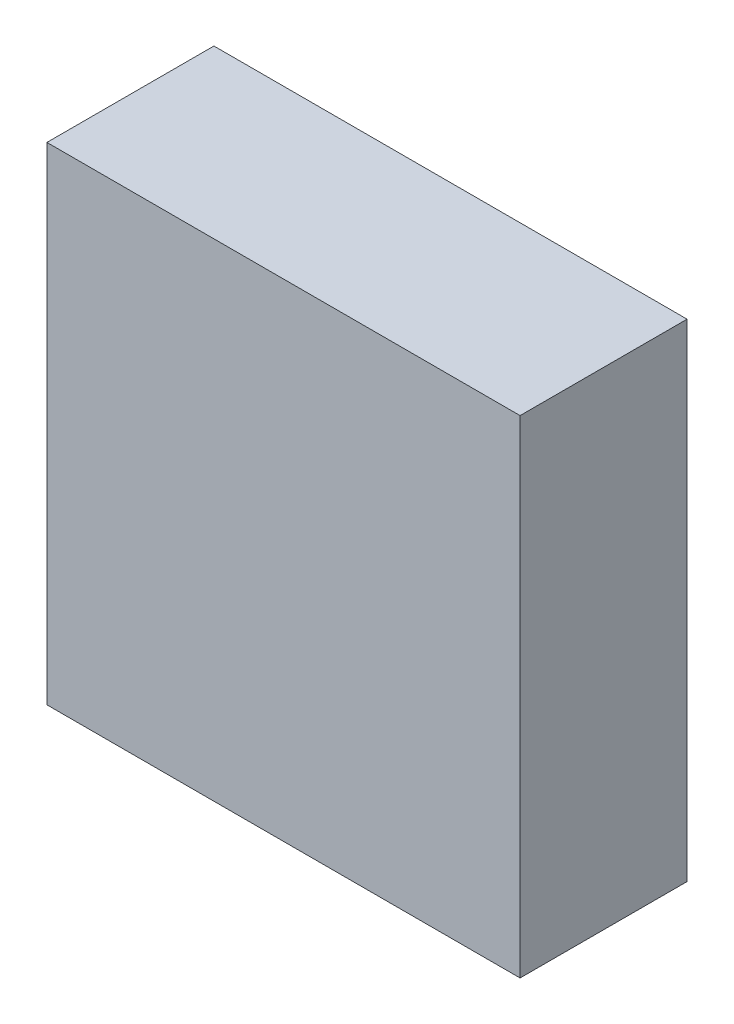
ISO-10303-21;
HEADER;
FILE_DESCRIPTION(('STEP AP214'),'2;1');
FILE_NAME('part.step','',(''),(''),'','','');
FILE_SCHEMA(('AUTOMOTIVE_DESIGN { 1 0 10303 214 1 1 1 1 }'));
ENDSEC;
DATA;
#1=APPLICATION_CONTEXT('core data for automotive mechanical design processes');
#2=APPLICATION_PROTOCOL_DEFINITION('international standard','automotive_design',2000,#1);
#3=PRODUCT_CONTEXT('',#1,'mechanical');
#4=PRODUCT('Part','Part','',(#3));
#5=PRODUCT_RELATED_PRODUCT_CATEGORY('part','',(#4));
#6=PRODUCT_DEFINITION_FORMATION('','',#4);
#7=PRODUCT_DEFINITION_CONTEXT('part definition',#1,'design');
#8=PRODUCT_DEFINITION('design','',#6,#7);
#9=PRODUCT_DEFINITION_SHAPE('','',#8);
#10=(LENGTH_UNIT() NAMED_UNIT(*) SI_UNIT(.MILLI.,.METRE.));
#11=(NAMED_UNIT(*) PLANE_ANGLE_UNIT() SI_UNIT($,.RADIAN.));
#12=(NAMED_UNIT(*) SI_UNIT($,.STERADIAN.) SOLID_ANGLE_UNIT());
#13=UNCERTAINTY_MEASURE_WITH_UNIT(LENGTH_MEASURE(1.E-05),#10,'distance_accuracy_value','');
#14=(GEOMETRIC_REPRESENTATION_CONTEXT(3) GLOBAL_UNCERTAINTY_ASSIGNED_CONTEXT((#13)) GLOBAL_UNIT_ASSIGNED_CONTEXT((#10,
#11,#12)) REPRESENTATION_CONTEXT('',''));
#15=CARTESIAN_POINT('',(0.,0.,0.));
#16=DIRECTION('',(0.,0.,1.));
#17=DIRECTION('',(1.,0.,0.));
#18=AXIS2_PLACEMENT_3D('',#15,#16,#17);
#19=CARTESIAN_POINT('',(-34.0000000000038,-34.999999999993,-23.9999999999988));
#20=DIRECTION('',(-0.999999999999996,0.,0.));
#21=DIRECTION('',(0.,-0.999999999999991,0.));
#22=AXIS2_PLACEMENT_3D('',#19,#20,#21);
#23=PLANE('',#22);
#24=CARTESIAN_POINT('',(-34.0000000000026,-22.999999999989,-11.9999999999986));
#25=DIRECTION('',(-0.999999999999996,0.,0.));
#26=DIRECTION('',(0.,-0.999999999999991,0.));
#27=AXIS2_PLACEMENT_3D('',#24,#25,#26);
#28=CIRCLE('',#27,6.69999999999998);
#29=CARTESIAN_POINT('',(-34.0000000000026,-22.999999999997,-5.29999999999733));
#30=VERTEX_POINT('',#29);
#31=EDGE_CURVE('E49',#30,#30,#28,.F.);
#32=ORIENTED_EDGE('',*,*,#31,.T.);
#33=EDGE_LOOP('',(#32));
#34=FACE_BOUND('',#33,.T.);
#35=CARTESIAN_POINT('',(-34.0000000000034,23.00000000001,-11.9999999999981));
#36=DIRECTION('',(-0.999999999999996,0.,0.));
#37=DIRECTION('',(0.,-0.999999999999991,0.));
#38=AXIS2_PLACEMENT_3D('',#35,#36,#37);
#39=CIRCLE('',#38,6.69999999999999);
#40=CARTESIAN_POINT('',(-34.0000000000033,23.0000000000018,-5.29999999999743));
#41=VERTEX_POINT('',#40);
#42=EDGE_CURVE('E137',#41,#41,#39,.F.);
#43=ORIENTED_EDGE('',*,*,#42,.T.);
#44=EDGE_LOOP('',(#43));
#45=FACE_BOUND('',#44,.T.);
#46=DIRECTION('',(0.,-0.999999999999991,0.));
#47=VECTOR('',#46,1.);
#48=CARTESIAN_POINT('',(-33.9999999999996,-34.999999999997,9.15933995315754E-13));
#49=LINE('',#48,#47);
#50=CARTESIAN_POINT('',(-34.0000000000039,35.0000000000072,1.45716771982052E-12));
#51=VERTEX_POINT('',#50);
#52=CARTESIAN_POINT('',(-33.9999999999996,-34.999999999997,9.15933995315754E-13));
#53=VERTEX_POINT('',#52);
#54=EDGE_CURVE('E108',#51,#53,#49,.T.);
#55=ORIENTED_EDGE('',*,*,#54,.F.);
#56=DIRECTION('',(0.,0.,0.999999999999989));
#57=VECTOR('',#56,1.);
#58=CARTESIAN_POINT('',(-34.000000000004,35.0000000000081,-23.9999999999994));
#59=LINE('',#58,#57);
#60=CARTESIAN_POINT('',(-34.000000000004,35.0000000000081,-23.9999999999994));
#61=VERTEX_POINT('',#60);
#62=EDGE_CURVE('E57',#61,#51,#59,.T.);
#63=ORIENTED_EDGE('',*,*,#62,.F.);
#64=DIRECTION('',(0.,-0.999999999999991,0.));
#65=VECTOR('',#64,1.);
#66=CARTESIAN_POINT('',(-34.0000000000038,-34.999999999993,-23.9999999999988));
#67=LINE('',#66,#65);
#68=CARTESIAN_POINT('',(-34.0000000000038,-34.999999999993,-23.9999999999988));
#69=VERTEX_POINT('',#68);
#70=EDGE_CURVE('E111',#61,#69,#67,.T.);
#71=ORIENTED_EDGE('',*,*,#70,.T.);
#72=DIRECTION('',(0.,0.,0.999999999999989));
#73=VECTOR('',#72,1.);
#74=CARTESIAN_POINT('',(-34.0000000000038,-34.999999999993,-23.9999999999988));
#75=LINE('',#74,#73);
#76=EDGE_CURVE('E86',#69,#53,#75,.T.);
#77=ORIENTED_EDGE('',*,*,#76,.T.);
#78=EDGE_LOOP('',(#55,#63,#71,#77));
#79=FACE_BOUND('',#78,.T.);
#80=ADVANCED_FACE('F40',(#34,#45,#79),#23,.T.);
#81=CARTESIAN_POINT('',(33.9999999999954,35.000000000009,-23.999999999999));
#82=DIRECTION('',(0.,0.999999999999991,0.));
#83=DIRECTION('',(-0.999999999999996,0.,0.));
#84=AXIS2_PLACEMENT_3D('',#81,#82,#83);
#85=PLANE('',#84);
#86=DIRECTION('',(-0.999999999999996,0.,0.));
#87=VECTOR('',#86,1.);
#88=CARTESIAN_POINT('',(33.9999999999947,35.0000000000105,6.52256026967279E-13));
#89=LINE('',#88,#87);
#90=CARTESIAN_POINT('',(33.9999999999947,35.0000000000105,6.52256026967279E-13));
#91=VERTEX_POINT('',#90);
#92=EDGE_CURVE('E114',#91,#51,#89,.T.);
#93=ORIENTED_EDGE('',*,*,#92,.F.);
#94=DIRECTION('',(0.,0.,0.999999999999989));
#95=VECTOR('',#94,1.);
#96=CARTESIAN_POINT('',(33.9999999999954,35.000000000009,-23.999999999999));
#97=LINE('',#96,#95);
#98=CARTESIAN_POINT('',(33.9999999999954,35.000000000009,-23.999999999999));
#99=VERTEX_POINT('',#98);
#100=EDGE_CURVE('E75',#99,#91,#97,.T.);
#101=ORIENTED_EDGE('',*,*,#100,.F.);
#102=DIRECTION('',(-0.999999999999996,0.,0.));
#103=VECTOR('',#102,1.);
#104=CARTESIAN_POINT('',(33.9999999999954,35.000000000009,-23.999999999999));
#105=LINE('',#104,#103);
#106=EDGE_CURVE('E118',#99,#61,#105,.T.);
#107=ORIENTED_EDGE('',*,*,#106,.T.);
#108=ORIENTED_EDGE('',*,*,#62,.T.);
#109=EDGE_LOOP('',(#93,#101,#107,#108));
#110=FACE_BOUND('',#109,.T.);
#111=ADVANCED_FACE('F167',(#110),#85,.T.);
#112=CARTESIAN_POINT('',(33.9999999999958,-34.9999999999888,-23.9999999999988));
#113=DIRECTION('',(0.999999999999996,0.,0.));
#114=DIRECTION('',(0.,0.999999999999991,0.));
#115=AXIS2_PLACEMENT_3D('',#112,#113,#114);
#116=PLANE('',#115);
#117=DIRECTION('',(0.,0.999999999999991,0.));
#118=VECTOR('',#117,1.);
#119=CARTESIAN_POINT('',(33.9999999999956,-34.9999999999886,3.60822483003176E-13));
#120=LINE('',#119,#118);
#121=CARTESIAN_POINT('',(33.9999999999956,-34.9999999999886,3.60822483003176E-13));
#122=VERTEX_POINT('',#121);
#123=EDGE_CURVE('E125',#122,#91,#120,.T.);
#124=ORIENTED_EDGE('',*,*,#123,.F.);
#125=DIRECTION('',(0.,0.,0.999999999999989));
#126=VECTOR('',#125,1.);
#127=CARTESIAN_POINT('',(33.9999999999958,-34.9999999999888,-23.9999999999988));
#128=LINE('',#127,#126);
#129=CARTESIAN_POINT('',(33.9999999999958,-34.9999999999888,-23.9999999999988));
#130=VERTEX_POINT('',#129);
#131=EDGE_CURVE('E132',#130,#122,#128,.T.);
#132=ORIENTED_EDGE('',*,*,#131,.F.);
#133=DIRECTION('',(0.,0.999999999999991,0.));
#134=VECTOR('',#133,1.);
#135=CARTESIAN_POINT('',(33.9999999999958,-34.9999999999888,-23.9999999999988));
#136=LINE('',#135,#134);
#137=EDGE_CURVE('E116',#130,#99,#136,.T.);
#138=ORIENTED_EDGE('',*,*,#137,.T.);
#139=ORIENTED_EDGE('',*,*,#100,.T.);
#140=EDGE_LOOP('',(#124,#132,#138,#139));
#141=FACE_BOUND('',#140,.T.);
#142=ADVANCED_FACE('F172',(#141),#116,.T.);
#143=CARTESIAN_POINT('',(33.9999999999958,-34.9999999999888,-23.9999999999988));
#144=DIRECTION('',(0.,-0.999999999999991,0.));
#145=DIRECTION('',(0.999999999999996,0.,0.));
#146=AXIS2_PLACEMENT_3D('',#143,#144,#145);
#147=PLANE('',#146);
#148=DIRECTION('',(0.999999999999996,0.,0.));
#149=VECTOR('',#148,1.);
#150=CARTESIAN_POINT('',(33.9999999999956,-34.9999999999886,3.60822483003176E-13));
#151=LINE('',#150,#149);
#152=EDGE_CURVE('E122',#53,#122,#151,.T.);
#153=ORIENTED_EDGE('',*,*,#152,.F.);
#154=ORIENTED_EDGE('',*,*,#76,.F.);
#155=DIRECTION('',(0.999999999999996,0.,0.));
#156=VECTOR('',#155,1.);
#157=CARTESIAN_POINT('',(33.9999999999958,-34.9999999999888,-23.9999999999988));
#158=LINE('',#157,#156);
#159=EDGE_CURVE('E113',#69,#130,#158,.T.);
#160=ORIENTED_EDGE('',*,*,#159,.T.);
#161=ORIENTED_EDGE('',*,*,#131,.T.);
#162=EDGE_LOOP('',(#153,#154,#160,#161));
#163=FACE_BOUND('',#162,.T.);
#164=ADVANCED_FACE('F175',(#163),#147,.T.);
#165=CARTESIAN_POINT('',(-3.44169137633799E-12,1.13242748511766E-11,-23.9999999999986));
#166=DIRECTION('',(0.,0.,0.999999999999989));
#167=DIRECTION('',(0.999999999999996,0.,0.));
#168=AXIS2_PLACEMENT_3D('',#165,#166,#167);
#169=PLANE('',#168);
#170=ORIENTED_EDGE('',*,*,#70,.F.);
#171=ORIENTED_EDGE('',*,*,#106,.F.);
#172=ORIENTED_EDGE('',*,*,#137,.F.);
#173=ORIENTED_EDGE('',*,*,#159,.F.);
#174=EDGE_LOOP('',(#170,#171,#172,#173));
#175=FACE_BOUND('',#174,.T.);
#176=ADVANCED_FACE('F162',(#175),#169,.F.);
#177=CARTESIAN_POINT('',(0.,0.,0.));
#178=DIRECTION('',(0.,0.,0.999999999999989));
#179=DIRECTION('',(0.999999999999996,0.,0.));
#180=AXIS2_PLACEMENT_3D('',#177,#178,#179);
#181=PLANE('',#180);
#182=ORIENTED_EDGE('',*,*,#54,.T.);
#183=ORIENTED_EDGE('',*,*,#152,.T.);
#184=ORIENTED_EDGE('',*,*,#123,.T.);
#185=ORIENTED_EDGE('',*,*,#92,.T.);
#186=EDGE_LOOP('',(#182,#183,#184,#185));
#187=FACE_BOUND('',#186,.T.);
#188=ADVANCED_FACE('F156',(#187),#181,.T.);
#189=CARTESIAN_POINT('',(-2.00000000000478,-22.9999999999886,-11.9999999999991));
#190=DIRECTION('',(-0.999999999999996,0.,0.));
#191=DIRECTION('',(0.,0.,0.999999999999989));
#192=AXIS2_PLACEMENT_3D('',#189,#190,#191);
#193=CONICAL_SURFACE('',#192,5.09999999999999,1.02974425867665);
#194=CARTESIAN_POINT('',(1.06438915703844,-22.9999999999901,-11.9999999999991));
#195=VERTEX_POINT('',#194);
#196=VERTEX_LOOP('',#195);
#197=FACE_BOUND('',#196,.T.);
#198=CARTESIAN_POINT('',(-2.00000000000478,-22.9999999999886,-11.9999999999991));
#199=DIRECTION('',(-0.999999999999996,0.,0.));
#200=DIRECTION('',(0.,0.,0.999999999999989));
#201=AXIS2_PLACEMENT_3D('',#198,#199,#200);
#202=CIRCLE('',#201,5.09999999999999);
#203=CARTESIAN_POINT('',(-2.00000000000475,-22.9999999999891,-6.8999999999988));
#204=VERTEX_POINT('',#203);
#205=EDGE_CURVE('E105',#204,#204,#202,.T.);
#206=ORIENTED_EDGE('',*,*,#205,.T.);
#207=EDGE_LOOP('',(#206));
#208=FACE_BOUND('',#207,.T.);
#209=ADVANCED_FACE('F151',(#197,#208),#193,.F.);
#210=CARTESIAN_POINT('',(-34.0000000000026,-22.999999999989,-11.9999999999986));
#211=DIRECTION('',(-0.999999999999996,0.,0.));
#212=DIRECTION('',(0.,0.,0.999999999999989));
#213=AXIS2_PLACEMENT_3D('',#210,#211,#212);
#214=CYLINDRICAL_SURFACE('',#213,5.09999999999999);
#215=CARTESIAN_POINT('',(-32.4000000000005,-22.999999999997,-11.9999999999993));
#216=DIRECTION('',(-0.999999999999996,0.,0.));
#217=DIRECTION('',(0.,0.,0.999999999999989));
#218=AXIS2_PLACEMENT_3D('',#215,#216,#217);
#219=CIRCLE('',#218,5.09999999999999);
#220=CARTESIAN_POINT('',(-32.4000000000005,-22.999999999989,-6.89999999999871));
#221=VERTEX_POINT('',#220);
#222=EDGE_CURVE('E130',#221,#221,#219,.T.);
#223=CARTESIAN_POINT('',(-32.4000000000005,-22.999999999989,-6.89999999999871));
#224=CARTESIAN_POINT('',(-32.0833333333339,-22.999999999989,-6.89999999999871));
#225=CARTESIAN_POINT('',(-31.7666666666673,-22.999999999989,-6.89999999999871));
#226=CARTESIAN_POINT('',(-31.133333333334,-22.999999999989,-6.89999999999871));
#227=CARTESIAN_POINT('',(-30.8166666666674,-22.999999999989,-6.89999999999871));
#228=CARTESIAN_POINT('',(-30.1833333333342,-22.999999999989,-6.89999999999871));
#229=CARTESIAN_POINT('',(-29.8666666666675,-22.999999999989,-6.89999999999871));
#230=CARTESIAN_POINT('',(-29.2333333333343,-22.999999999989,-6.89999999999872));
#231=CARTESIAN_POINT('',(-28.9166666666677,-22.999999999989,-6.89999999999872));
#232=CARTESIAN_POINT('',(-28.2833333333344,-22.999999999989,-6.89999999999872));
#233=CARTESIAN_POINT('',(-27.9666666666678,-22.999999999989,-6.89999999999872));
#234=CARTESIAN_POINT('',(-27.3333333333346,-22.999999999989,-6.89999999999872));
#235=CARTESIAN_POINT('',(-27.0166666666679,-22.999999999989,-6.89999999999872));
#236=CARTESIAN_POINT('',(-26.3833333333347,-22.999999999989,-6.89999999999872));
#237=CARTESIAN_POINT('',(-26.0666666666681,-22.999999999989,-6.89999999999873));
#238=CARTESIAN_POINT('',(-25.4333333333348,-22.999999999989,-6.89999999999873));
#239=CARTESIAN_POINT('',(-25.1166666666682,-22.999999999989,-6.89999999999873));
#240=CARTESIAN_POINT('',(-24.483333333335,-22.999999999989,-6.89999999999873));
#241=CARTESIAN_POINT('',(-24.1666666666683,-22.999999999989,-6.89999999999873));
#242=CARTESIAN_POINT('',(-23.5333333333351,-22.999999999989,-6.89999999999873));
#243=CARTESIAN_POINT('',(-23.2166666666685,-22.9999999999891,-6.89999999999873));
#244=CARTESIAN_POINT('',(-22.5833333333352,-22.9999999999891,-6.89999999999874));
#245=CARTESIAN_POINT('',(-22.2666666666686,-22.9999999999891,-6.89999999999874));
#246=CARTESIAN_POINT('',(-21.6333333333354,-22.9999999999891,-6.89999999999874));
#247=CARTESIAN_POINT('',(-21.3166666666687,-22.9999999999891,-6.89999999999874));
#248=CARTESIAN_POINT('',(-20.6833333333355,-22.9999999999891,-6.89999999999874));
#249=CARTESIAN_POINT('',(-20.3666666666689,-22.9999999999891,-6.89999999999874));
#250=CARTESIAN_POINT('',(-19.7333333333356,-22.9999999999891,-6.89999999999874));
#251=CARTESIAN_POINT('',(-19.416666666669,-22.9999999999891,-6.89999999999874));
#252=CARTESIAN_POINT('',(-18.7833333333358,-22.9999999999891,-6.89999999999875));
#253=CARTESIAN_POINT('',(-18.4666666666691,-22.9999999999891,-6.89999999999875));
#254=CARTESIAN_POINT('',(-17.8333333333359,-22.9999999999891,-6.89999999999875));
#255=CARTESIAN_POINT('',(-17.5166666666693,-22.9999999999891,-6.89999999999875));
#256=CARTESIAN_POINT('',(-16.883333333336,-22.9999999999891,-6.89999999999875));
#257=CARTESIAN_POINT('',(-16.5666666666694,-22.9999999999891,-6.89999999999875));
#258=CARTESIAN_POINT('',(-15.9333333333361,-22.9999999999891,-6.89999999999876));
#259=CARTESIAN_POINT('',(-15.6166666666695,-22.9999999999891,-6.89999999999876));
#260=CARTESIAN_POINT('',(-14.9833333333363,-22.9999999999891,-6.89999999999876));
#261=CARTESIAN_POINT('',(-14.6666666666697,-22.9999999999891,-6.89999999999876));
#262=CARTESIAN_POINT('',(-14.0333333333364,-22.9999999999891,-6.89999999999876));
#263=CARTESIAN_POINT('',(-13.7166666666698,-22.9999999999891,-6.89999999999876));
#264=CARTESIAN_POINT('',(-13.0833333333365,-22.9999999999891,-6.89999999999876));
#265=CARTESIAN_POINT('',(-12.7666666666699,-22.9999999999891,-6.89999999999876));
#266=CARTESIAN_POINT('',(-12.1333333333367,-22.9999999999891,-6.89999999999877));
#267=CARTESIAN_POINT('',(-11.8166666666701,-22.9999999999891,-6.89999999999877));
#268=CARTESIAN_POINT('',(-11.1833333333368,-22.9999999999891,-6.89999999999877));
#269=CARTESIAN_POINT('',(-10.8666666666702,-22.9999999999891,-6.89999999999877));
#270=CARTESIAN_POINT('',(-10.2333333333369,-22.9999999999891,-6.89999999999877));
#271=CARTESIAN_POINT('',(-9.91666666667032,-22.9999999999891,-6.89999999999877));
#272=CARTESIAN_POINT('',(-9.28333333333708,-22.9999999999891,-6.89999999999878));
#273=CARTESIAN_POINT('',(-8.96666666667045,-22.9999999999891,-6.89999999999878));
#274=CARTESIAN_POINT('',(-8.33333333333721,-22.9999999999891,-6.89999999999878));
#275=CARTESIAN_POINT('',(-8.01666666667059,-22.9999999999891,-6.89999999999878));
#276=CARTESIAN_POINT('',(-7.38333333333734,-22.9999999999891,-6.89999999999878));
#277=CARTESIAN_POINT('',(-7.06666666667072,-22.9999999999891,-6.89999999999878));
#278=CARTESIAN_POINT('',(-6.43333333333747,-22.9999999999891,-6.89999999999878));
#279=CARTESIAN_POINT('',(-6.11666666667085,-22.9999999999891,-6.89999999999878));
#280=CARTESIAN_POINT('',(-5.4833333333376,-22.9999999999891,-6.89999999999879));
#281=CARTESIAN_POINT('',(-5.16666666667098,-22.9999999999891,-6.89999999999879));
#282=CARTESIAN_POINT('',(-4.53333333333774,-22.9999999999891,-6.89999999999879));
#283=CARTESIAN_POINT('',(-4.21666666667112,-22.9999999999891,-6.89999999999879));
#284=CARTESIAN_POINT('',(-3.58333333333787,-22.9999999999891,-6.89999999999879));
#285=CARTESIAN_POINT('',(-3.26666666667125,-22.9999999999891,-6.89999999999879));
#286=CARTESIAN_POINT('',(-2.633333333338,-22.9999999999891,-6.8999999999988));
#287=CARTESIAN_POINT('',(-2.31666666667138,-22.9999999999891,-6.8999999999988));
#288=CARTESIAN_POINT('',(-2.00000000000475,-22.9999999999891,-6.8999999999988));
#289=B_SPLINE_CURVE_WITH_KNOTS('',3,(#223,#224,#225,#226,#227,#228,#229,#230,#231,#232,#233,
#234,#235,#236,#237,#238,#239,#240,#241,#242,#243,#244,#245,#246,#247,#248,#249,#250,#251,#252,
#253,#254,#255,#256,#257,#258,#259,#260,#261,#262,#263,#264,#265,#266,#267,#268,#269,#270,#271,
#272,#273,#274,#275,#276,#277,#278,#279,#280,#281,#282,#283,#284,#285,#286,#287,#288),
.UNSPECIFIED.,.F.,.F.,(4,2,2,2,2,2,2,2,2,2,2,2,2,2,2,2,2,2,2,2,2,2,2,2,2,2,2,2,2,2,2,2,4),(0.,
0.949999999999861,1.89999999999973,2.8499999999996,3.79999999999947,4.74999999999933,
5.6999999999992,6.64999999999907,7.59999999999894,8.54999999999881,9.49999999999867,
10.4499999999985,11.3999999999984,12.3499999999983,13.2999999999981,14.249999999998,
15.1999999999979,16.1499999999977,17.0999999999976,18.0499999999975,18.9999999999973,
19.9499999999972,20.8999999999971,21.849999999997,22.7999999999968,23.7499999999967,
24.6999999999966,25.6499999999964,26.5999999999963,27.5499999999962,28.499999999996,
29.4499999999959,30.3999999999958),.UNSPECIFIED.);
#290=EDGE_CURVE('BSEAM99',#221,#204,#289,.T.);
#291=ORIENTED_EDGE('',*,*,#222,.T.);
#292=ORIENTED_EDGE('',*,*,#205,.F.);
#293=ORIENTED_EDGE('',*,*,#290,.T.);
#294=ORIENTED_EDGE('',*,*,#290,.F.);
#295=EDGE_LOOP('',(#291,#293,#292,#294));
#296=FACE_BOUND('',#295,.T.);
#297=ADVANCED_FACE('F99',(#296),#214,.F.);
#298=CARTESIAN_POINT('',(-2.00000000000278,23.0000000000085,-11.9999999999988));
#299=DIRECTION('',(-0.999999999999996,0.,0.));
#300=DIRECTION('',(0.,0.,0.999999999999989));
#301=AXIS2_PLACEMENT_3D('',#298,#299,#300);
#302=CONICAL_SURFACE('',#301,5.09999999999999,1.02974425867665);
#303=CARTESIAN_POINT('',(1.06438915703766,23.0000000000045,-11.9999999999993));
#304=VERTEX_POINT('',#303);
#305=VERTEX_LOOP('',#304);
#306=FACE_BOUND('',#305,.T.);
#307=CARTESIAN_POINT('',(-2.00000000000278,23.0000000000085,-11.9999999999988));
#308=DIRECTION('',(-0.999999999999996,0.,0.));
#309=DIRECTION('',(0.,0.,0.999999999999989));
#310=AXIS2_PLACEMENT_3D('',#307,#308,#309);
#311=CIRCLE('',#310,5.09999999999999);
#312=CARTESIAN_POINT('',(-2.00000000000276,23.0000000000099,-6.89999999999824));
#313=VERTEX_POINT('',#312);
#314=EDGE_CURVE('E103',#313,#313,#311,.T.);
#315=ORIENTED_EDGE('',*,*,#314,.T.);
#316=EDGE_LOOP('',(#315));
#317=FACE_BOUND('',#316,.T.);
#318=ADVANCED_FACE('F95',(#306,#317),#302,.F.);
#319=CARTESIAN_POINT('',(-34.0000000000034,23.00000000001,-11.9999999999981));
#320=DIRECTION('',(-0.999999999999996,0.,0.));
#321=DIRECTION('',(0.,0.,0.999999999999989));
#322=AXIS2_PLACEMENT_3D('',#319,#320,#321);
#323=CYLINDRICAL_SURFACE('',#322,5.09999999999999);
#324=CARTESIAN_POINT('',(-32.4000000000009,23.0000000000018,-11.9999999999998));
#325=DIRECTION('',(-0.999999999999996,0.,0.));
#326=DIRECTION('',(0.,0.,0.999999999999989));
#327=AXIS2_PLACEMENT_3D('',#324,#325,#326);
#328=CIRCLE('',#327,5.09999999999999);
#329=CARTESIAN_POINT('',(-32.4000000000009,23.00000000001,-6.89999999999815));
#330=VERTEX_POINT('',#329);
#331=EDGE_CURVE('E11',#330,#330,#328,.T.);
#332=CARTESIAN_POINT('',(-32.4000000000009,23.00000000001,-6.89999999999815));
#333=CARTESIAN_POINT('',(-32.0833333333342,23.00000000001,-6.89999999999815));
#334=CARTESIAN_POINT('',(-31.7666666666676,23.00000000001,-6.89999999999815));
#335=CARTESIAN_POINT('',(-31.1333333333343,23.00000000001,-6.89999999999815));
#336=CARTESIAN_POINT('',(-30.8166666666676,23.00000000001,-6.89999999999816));
#337=CARTESIAN_POINT('',(-30.1833333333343,23.00000000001,-6.89999999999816));
#338=CARTESIAN_POINT('',(-29.8666666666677,23.00000000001,-6.89999999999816));
#339=CARTESIAN_POINT('',(-29.2333333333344,23.00000000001,-6.89999999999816));
#340=CARTESIAN_POINT('',(-28.9166666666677,23.00000000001,-6.89999999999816));
#341=CARTESIAN_POINT('',(-28.2833333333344,23.00000000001,-6.89999999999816));
#342=CARTESIAN_POINT('',(-27.9666666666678,23.00000000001,-6.89999999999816));
#343=CARTESIAN_POINT('',(-27.3333333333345,23.00000000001,-6.89999999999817));
#344=CARTESIAN_POINT('',(-27.0166666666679,23.00000000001,-6.89999999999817));
#345=CARTESIAN_POINT('',(-26.3833333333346,23.00000000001,-6.89999999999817));
#346=CARTESIAN_POINT('',(-26.0666666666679,23.00000000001,-6.89999999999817));
#347=CARTESIAN_POINT('',(-25.4333333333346,23.00000000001,-6.89999999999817));
#348=CARTESIAN_POINT('',(-25.116666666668,23.00000000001,-6.89999999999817));
#349=CARTESIAN_POINT('',(-24.4833333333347,23.00000000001,-6.89999999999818));
#350=CARTESIAN_POINT('',(-24.166666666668,23.00000000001,-6.89999999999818));
#351=CARTESIAN_POINT('',(-23.5333333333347,23.00000000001,-6.89999999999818));
#352=CARTESIAN_POINT('',(-23.2166666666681,23.00000000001,-6.89999999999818));
#353=CARTESIAN_POINT('',(-22.5833333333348,23.00000000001,-6.89999999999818));
#354=CARTESIAN_POINT('',(-22.2666666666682,23.00000000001,-6.89999999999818));
#355=CARTESIAN_POINT('',(-21.6333333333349,23.00000000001,-6.89999999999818));
#356=CARTESIAN_POINT('',(-21.3166666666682,23.00000000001,-6.89999999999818));
#357=CARTESIAN_POINT('',(-20.6833333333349,23.00000000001,-6.89999999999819));
#358=CARTESIAN_POINT('',(-20.3666666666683,23.00000000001,-6.89999999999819));
#359=CARTESIAN_POINT('',(-19.733333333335,23.00000000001,-6.89999999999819));
#360=CARTESIAN_POINT('',(-19.4166666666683,23.00000000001,-6.89999999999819));
#361=CARTESIAN_POINT('',(-18.783333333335,23.00000000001,-6.89999999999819));
#362=CARTESIAN_POINT('',(-18.4666666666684,23.00000000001,-6.89999999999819));
#363=CARTESIAN_POINT('',(-17.8333333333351,23.00000000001,-6.89999999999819));
#364=CARTESIAN_POINT('',(-17.5166666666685,23.00000000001,-6.8999999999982));
#365=CARTESIAN_POINT('',(-16.8833333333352,23.00000000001,-6.8999999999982));
#366=CARTESIAN_POINT('',(-16.5666666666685,23.00000000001,-6.8999999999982));
#367=CARTESIAN_POINT('',(-15.9333333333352,23.00000000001,-6.8999999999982));
#368=CARTESIAN_POINT('',(-15.6166666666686,23.00000000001,-6.8999999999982));
#369=CARTESIAN_POINT('',(-14.9833333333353,23.00000000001,-6.8999999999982));
#370=CARTESIAN_POINT('',(-14.6666666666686,23.00000000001,-6.8999999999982));
#371=CARTESIAN_POINT('',(-14.0333333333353,23.00000000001,-6.89999999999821));
#372=CARTESIAN_POINT('',(-13.7166666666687,23.00000000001,-6.89999999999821));
#373=CARTESIAN_POINT('',(-13.0833333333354,23.00000000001,-6.89999999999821));
#374=CARTESIAN_POINT('',(-12.7666666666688,23.00000000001,-6.89999999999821));
#375=CARTESIAN_POINT('',(-12.1333333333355,23.00000000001,-6.89999999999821));
#376=CARTESIAN_POINT('',(-11.8166666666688,23.00000000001,-6.89999999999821));
#377=CARTESIAN_POINT('',(-11.1833333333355,23.00000000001,-6.89999999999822));
#378=CARTESIAN_POINT('',(-10.8666666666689,23.00000000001,-6.89999999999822));
#379=CARTESIAN_POINT('',(-10.2333333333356,23.00000000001,-6.89999999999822));
#380=CARTESIAN_POINT('',(-9.91666666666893,23.00000000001,-6.89999999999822));
#381=CARTESIAN_POINT('',(-9.28333333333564,23.00000000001,-6.89999999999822));
#382=CARTESIAN_POINT('',(-8.96666666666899,23.00000000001,-6.89999999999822));
#383=CARTESIAN_POINT('',(-8.3333333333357,23.00000000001,-6.89999999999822));
#384=CARTESIAN_POINT('',(-8.01666666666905,23.00000000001,-6.89999999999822));
#385=CARTESIAN_POINT('',(-7.38333333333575,23.00000000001,-6.89999999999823));
#386=CARTESIAN_POINT('',(-7.06666666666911,23.00000000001,-6.89999999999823));
#387=CARTESIAN_POINT('',(-6.43333333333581,23.00000000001,-6.89999999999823));
#388=CARTESIAN_POINT('',(-6.11666666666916,23.0000000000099,-6.89999999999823));
#389=CARTESIAN_POINT('',(-5.48333333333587,23.0000000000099,-6.89999999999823));
#390=CARTESIAN_POINT('',(-5.16666666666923,23.0000000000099,-6.89999999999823));
#391=CARTESIAN_POINT('',(-4.53333333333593,23.0000000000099,-6.89999999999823));
#392=CARTESIAN_POINT('',(-4.21666666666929,23.0000000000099,-6.89999999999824));
#393=CARTESIAN_POINT('',(-3.58333333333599,23.0000000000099,-6.89999999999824));
#394=CARTESIAN_POINT('',(-3.26666666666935,23.0000000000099,-6.89999999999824));
#395=CARTESIAN_POINT('',(-2.63333333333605,23.0000000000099,-6.89999999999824));
#396=CARTESIAN_POINT('',(-2.3166666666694,23.0000000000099,-6.89999999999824));
#397=CARTESIAN_POINT('',(-2.00000000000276,23.0000000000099,-6.89999999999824));
#398=B_SPLINE_CURVE_WITH_KNOTS('',3,(#332,#333,#334,#335,#336,#337,#338,#339,#340,#341,#342,
#343,#344,#345,#346,#347,#348,#349,#350,#351,#352,#353,#354,#355,#356,#357,#358,#359,#360,#361,
#362,#363,#364,#365,#366,#367,#368,#369,#370,#371,#372,#373,#374,#375,#376,#377,#378,#379,#380,
#381,#382,#383,#384,#385,#386,#387,#388,#389,#390,#391,#392,#393,#394,#395,#396,#397),
.UNSPECIFIED.,.F.,.F.,(4,2,2,2,2,2,2,2,2,2,2,2,2,2,2,2,2,2,2,2,2,2,2,2,2,2,2,2,2,2,2,2,4),(0.,
0.949999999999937,1.89999999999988,2.84999999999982,3.79999999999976,4.7499999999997,
5.69999999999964,6.64999999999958,7.59999999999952,8.54999999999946,9.4999999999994,
10.4499999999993,11.3999999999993,12.3499999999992,13.2999999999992,14.2499999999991,
15.199999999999,16.149999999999,17.0999999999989,18.0499999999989,18.9999999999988,
19.9499999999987,20.8999999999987,21.8499999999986,22.7999999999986,23.7499999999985,
24.6999999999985,25.6499999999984,26.5999999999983,27.5499999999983,28.4999999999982,
29.4499999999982,30.3999999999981),.UNSPECIFIED.);
#399=EDGE_CURVE('BSEAM98',#330,#313,#398,.T.);
#400=ORIENTED_EDGE('',*,*,#331,.T.);
#401=ORIENTED_EDGE('',*,*,#314,.F.);
#402=ORIENTED_EDGE('',*,*,#399,.T.);
#403=ORIENTED_EDGE('',*,*,#399,.F.);
#404=EDGE_LOOP('',(#400,#402,#401,#403));
#405=FACE_BOUND('',#404,.T.);
#406=ADVANCED_FACE('F98',(#405),#323,.F.);
#407=CARTESIAN_POINT('',(-32.4000000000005,-22.999999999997,-11.9999999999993));
#408=DIRECTION('',(-0.999999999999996,0.,0.));
#409=DIRECTION('',(0.,0.,0.999999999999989));
#410=AXIS2_PLACEMENT_3D('',#407,#408,#409);
#411=CONICAL_SURFACE('',#410,5.09999999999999,0.785398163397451);
#412=CARTESIAN_POINT('',(-34.0000000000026,-22.999999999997,-5.29999999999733));
#413=CARTESIAN_POINT('',(-33.9833333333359,-22.999999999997,-5.31666666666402));
#414=CARTESIAN_POINT('',(-33.9666666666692,-22.999999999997,-5.33333333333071));
#415=CARTESIAN_POINT('',(-33.9333333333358,-22.999999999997,-5.36666666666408));
#416=CARTESIAN_POINT('',(-33.9166666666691,-22.999999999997,-5.38333333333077));
#417=CARTESIAN_POINT('',(-33.8833333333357,-22.999999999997,-5.41666666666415));
#418=CARTESIAN_POINT('',(-33.8666666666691,-22.999999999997,-5.43333333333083));
#419=CARTESIAN_POINT('',(-33.8333333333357,-22.999999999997,-5.46666666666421));
#420=CARTESIAN_POINT('',(-33.816666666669,-22.999999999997,-5.4833333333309));
#421=CARTESIAN_POINT('',(-33.7833333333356,-22.999999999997,-5.51666666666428));
#422=CARTESIAN_POINT('',(-33.7666666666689,-22.999999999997,-5.53333333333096));
#423=CARTESIAN_POINT('',(-33.7333333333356,-22.999999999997,-5.56666666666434));
#424=CARTESIAN_POINT('',(-33.7166666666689,-22.999999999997,-5.58333333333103));
#425=CARTESIAN_POINT('',(-33.6833333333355,-22.999999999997,-5.6166666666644));
#426=CARTESIAN_POINT('',(-33.6666666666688,-22.999999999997,-5.63333333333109));
#427=CARTESIAN_POINT('',(-33.6333333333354,-22.999999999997,-5.66666666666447));
#428=CARTESIAN_POINT('',(-33.6166666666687,-22.999999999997,-5.68333333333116));
#429=CARTESIAN_POINT('',(-33.5833333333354,-22.999999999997,-5.71666666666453));
#430=CARTESIAN_POINT('',(-33.5666666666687,-22.999999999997,-5.73333333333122));
#431=CARTESIAN_POINT('',(-33.5333333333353,-22.999999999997,-5.76666666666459));
#432=CARTESIAN_POINT('',(-33.5166666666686,-22.999999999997,-5.78333333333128));
#433=CARTESIAN_POINT('',(-33.4833333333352,-22.999999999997,-5.81666666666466));
#434=CARTESIAN_POINT('',(-33.4666666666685,-22.999999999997,-5.83333333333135));
#435=CARTESIAN_POINT('',(-33.4333333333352,-22.999999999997,-5.86666666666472));
#436=CARTESIAN_POINT('',(-33.4166666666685,-22.999999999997,-5.88333333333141));
#437=CARTESIAN_POINT('',(-33.3833333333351,-22.999999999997,-5.91666666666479));
#438=CARTESIAN_POINT('',(-33.3666666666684,-22.999999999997,-5.93333333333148));
#439=CARTESIAN_POINT('',(-33.333333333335,-22.999999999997,-5.96666666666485));
#440=CARTESIAN_POINT('',(-33.3166666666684,-22.999999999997,-5.98333333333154));
#441=CARTESIAN_POINT('',(-33.283333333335,-22.999999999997,-6.01666666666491));
#442=CARTESIAN_POINT('',(-33.2666666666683,-22.999999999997,-6.0333333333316));
#443=CARTESIAN_POINT('',(-33.2333333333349,-22.999999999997,-6.06666666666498));
#444=CARTESIAN_POINT('',(-33.2166666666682,-22.999999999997,-6.08333333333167));
#445=CARTESIAN_POINT('',(-33.1833333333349,-22.999999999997,-6.11666666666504));
#446=CARTESIAN_POINT('',(-33.1666666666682,-22.999999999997,-6.13333333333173));
#447=CARTESIAN_POINT('',(-33.1333333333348,-22.999999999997,-6.16666666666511));
#448=CARTESIAN_POINT('',(-33.1166666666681,-22.999999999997,-6.18333333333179));
#449=CARTESIAN_POINT('',(-33.0833333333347,-22.999999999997,-6.21666666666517));
#450=CARTESIAN_POINT('',(-33.066666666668,-22.999999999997,-6.23333333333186));
#451=CARTESIAN_POINT('',(-33.0333333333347,-22.999999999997,-6.26666666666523));
#452=CARTESIAN_POINT('',(-33.016666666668,-22.999999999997,-6.28333333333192));
#453=CARTESIAN_POINT('',(-32.9833333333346,-22.999999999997,-6.3166666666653));
#454=CARTESIAN_POINT('',(-32.9666666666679,-22.999999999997,-6.33333333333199));
#455=CARTESIAN_POINT('',(-32.9333333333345,-22.999999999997,-6.36666666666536));
#456=CARTESIAN_POINT('',(-32.9166666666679,-22.999999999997,-6.38333333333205));
#457=CARTESIAN_POINT('',(-32.8833333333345,-22.999999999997,-6.41666666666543));
#458=CARTESIAN_POINT('',(-32.8666666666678,-22.999999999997,-6.43333333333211));
#459=CARTESIAN_POINT('',(-32.8333333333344,-22.999999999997,-6.46666666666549));
#460=CARTESIAN_POINT('',(-32.8166666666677,-22.999999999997,-6.48333333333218));
#461=CARTESIAN_POINT('',(-32.7833333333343,-22.999999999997,-6.51666666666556));
#462=CARTESIAN_POINT('',(-32.7666666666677,-22.999999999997,-6.53333333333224));
#463=CARTESIAN_POINT('',(-32.7333333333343,-22.999999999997,-6.56666666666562));
#464=CARTESIAN_POINT('',(-32.7166666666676,-22.999999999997,-6.58333333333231));
#465=CARTESIAN_POINT('',(-32.6833333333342,-22.999999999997,-6.61666666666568));
#466=CARTESIAN_POINT('',(-32.6666666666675,-22.999999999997,-6.63333333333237));
#467=CARTESIAN_POINT('',(-32.6333333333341,-22.999999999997,-6.66666666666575));
#468=CARTESIAN_POINT('',(-32.6166666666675,-22.999999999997,-6.68333333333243));
#469=CARTESIAN_POINT('',(-32.5833333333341,-22.999999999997,-6.71666666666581));
#470=CARTESIAN_POINT('',(-32.5666666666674,-22.999999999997,-6.7333333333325));
#471=CARTESIAN_POINT('',(-32.533333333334,-22.999999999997,-6.76666666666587));
#472=CARTESIAN_POINT('',(-32.5166666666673,-22.999999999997,-6.78333333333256));
#473=CARTESIAN_POINT('',(-32.483333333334,-22.999999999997,-6.81666666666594));
#474=CARTESIAN_POINT('',(-32.4666666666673,-22.999999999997,-6.83333333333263));
#475=CARTESIAN_POINT('',(-32.4333333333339,-22.999999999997,-6.866666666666));
#476=CARTESIAN_POINT('',(-32.4166666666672,-22.999999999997,-6.88333333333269));
#477=CARTESIAN_POINT('',(-32.4000000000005,-22.999999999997,-6.89999999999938));
#478=B_SPLINE_CURVE_WITH_KNOTS('',3,(#412,#413,#414,#415,#416,#417,#418,#419,#420,#421,#422,
#423,#424,#425,#426,#427,#428,#429,#430,#431,#432,#433,#434,#435,#436,#437,#438,#439,#440,#441,
#442,#443,#444,#445,#446,#447,#448,#449,#450,#451,#452,#453,#454,#455,#456,#457,#458,#459,#460,
#461,#462,#463,#464,#465,#466,#467,#468,#469,#470,#471,#472,#473,#474,#475,#476,#477),
.UNSPECIFIED.,.F.,.F.,(4,2,2,2,2,2,2,2,2,2,2,2,2,2,2,2,2,2,2,2,2,2,2,2,2,2,2,2,2,2,2,2,4),(0.,
0.0707106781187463,0.141421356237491,0.212132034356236,0.282842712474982,0.353553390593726,
0.424264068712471,0.494974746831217,0.565685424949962,0.636396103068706,0.707106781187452,
0.777817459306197,0.848528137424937,0.919238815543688,0.989949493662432,1.06066017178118,
1.13137084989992,1.20208152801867,1.27279220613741,1.34350288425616,1.4142135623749,
1.48492424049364,1.55563491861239,1.62634559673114,1.69705627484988,1.76776695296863,
1.83847763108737,1.90918830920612,1.97989898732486,2.0506096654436,2.12132034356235,
2.1920310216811,2.26274169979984),.UNSPECIFIED.);
#479=EDGE_CURVE('BSEAM144',#30,#221,#478,.T.);
#480=ORIENTED_EDGE('',*,*,#31,.F.);
#481=ORIENTED_EDGE('',*,*,#222,.F.);
#482=ORIENTED_EDGE('',*,*,#479,.T.);
#483=ORIENTED_EDGE('',*,*,#479,.F.);
#484=EDGE_LOOP('',(#480,#482,#481,#483));
#485=FACE_BOUND('',#484,.T.);
#486=ADVANCED_FACE('F144',(#485),#411,.F.);
#487=CARTESIAN_POINT('',(-32.4000000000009,23.0000000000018,-11.9999999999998));
#488=DIRECTION('',(-0.999999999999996,0.,0.));
#489=DIRECTION('',(0.,0.,0.999999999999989));
#490=AXIS2_PLACEMENT_3D('',#487,#488,#489);
#491=CONICAL_SURFACE('',#490,5.09999999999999,0.785398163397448);
#492=CARTESIAN_POINT('',(-34.0000000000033,23.0000000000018,-5.29999999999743));
#493=CARTESIAN_POINT('',(-33.9833333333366,23.0000000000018,-5.31666666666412));
#494=CARTESIAN_POINT('',(-33.96666666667,23.0000000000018,-5.33333333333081));
#495=CARTESIAN_POINT('',(-33.9333333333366,23.0000000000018,-5.3666666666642));
#496=CARTESIAN_POINT('',(-33.9166666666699,23.0000000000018,-5.38333333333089));
#497=CARTESIAN_POINT('',(-33.8833333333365,23.0000000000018,-5.41666666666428));
#498=CARTESIAN_POINT('',(-33.8666666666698,23.0000000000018,-5.43333333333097));
#499=CARTESIAN_POINT('',(-33.8333333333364,23.0000000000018,-5.46666666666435));
#500=CARTESIAN_POINT('',(-33.8166666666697,23.0000000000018,-5.48333333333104));
#501=CARTESIAN_POINT('',(-33.7833333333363,23.0000000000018,-5.51666666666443));
#502=CARTESIAN_POINT('',(-33.7666666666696,23.0000000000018,-5.53333333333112));
#503=CARTESIAN_POINT('',(-33.7333333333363,23.0000000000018,-5.56666666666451));
#504=CARTESIAN_POINT('',(-33.7166666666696,23.0000000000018,-5.5833333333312));
#505=CARTESIAN_POINT('',(-33.6833333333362,23.0000000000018,-5.61666666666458));
#506=CARTESIAN_POINT('',(-33.6666666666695,23.0000000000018,-5.63333333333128));
#507=CARTESIAN_POINT('',(-33.6333333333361,23.0000000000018,-5.66666666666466));
#508=CARTESIAN_POINT('',(-33.6166666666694,23.0000000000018,-5.68333333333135));
#509=CARTESIAN_POINT('',(-33.583333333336,23.0000000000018,-5.71666666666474));
#510=CARTESIAN_POINT('',(-33.5666666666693,23.0000000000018,-5.73333333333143));
#511=CARTESIAN_POINT('',(-33.5333333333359,23.0000000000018,-5.76666666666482));
#512=CARTESIAN_POINT('',(-33.5166666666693,23.0000000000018,-5.78333333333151));
#513=CARTESIAN_POINT('',(-33.4833333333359,23.0000000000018,-5.81666666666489));
#514=CARTESIAN_POINT('',(-33.4666666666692,23.0000000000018,-5.83333333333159));
#515=CARTESIAN_POINT('',(-33.4333333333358,23.0000000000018,-5.86666666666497));
#516=CARTESIAN_POINT('',(-33.4166666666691,23.0000000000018,-5.88333333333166));
#517=CARTESIAN_POINT('',(-33.3833333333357,23.0000000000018,-5.91666666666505));
#518=CARTESIAN_POINT('',(-33.366666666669,23.0000000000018,-5.93333333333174));
#519=CARTESIAN_POINT('',(-33.3333333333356,23.0000000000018,-5.96666666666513));
#520=CARTESIAN_POINT('',(-33.3166666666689,23.0000000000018,-5.98333333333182));
#521=CARTESIAN_POINT('',(-33.2833333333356,23.0000000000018,-6.0166666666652));
#522=CARTESIAN_POINT('',(-33.2666666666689,23.0000000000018,-6.0333333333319));
#523=CARTESIAN_POINT('',(-33.2333333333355,23.0000000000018,-6.06666666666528));
#524=CARTESIAN_POINT('',(-33.2166666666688,23.0000000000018,-6.08333333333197));
#525=CARTESIAN_POINT('',(-33.1833333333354,23.0000000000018,-6.11666666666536));
#526=CARTESIAN_POINT('',(-33.1666666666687,23.0000000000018,-6.13333333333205));
#527=CARTESIAN_POINT('',(-33.1333333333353,23.0000000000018,-6.16666666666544));
#528=CARTESIAN_POINT('',(-33.1166666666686,23.0000000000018,-6.18333333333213));
#529=CARTESIAN_POINT('',(-33.0833333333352,23.0000000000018,-6.21666666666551));
#530=CARTESIAN_POINT('',(-33.0666666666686,23.0000000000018,-6.23333333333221));
#531=CARTESIAN_POINT('',(-33.0333333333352,23.0000000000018,-6.26666666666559));
#532=CARTESIAN_POINT('',(-33.0166666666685,23.0000000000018,-6.28333333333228));
#533=CARTESIAN_POINT('',(-32.9833333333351,23.0000000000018,-6.31666666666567));
#534=CARTESIAN_POINT('',(-32.9666666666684,23.0000000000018,-6.33333333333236));
#535=CARTESIAN_POINT('',(-32.933333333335,23.0000000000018,-6.36666666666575));
#536=CARTESIAN_POINT('',(-32.9166666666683,23.0000000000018,-6.38333333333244));
#537=CARTESIAN_POINT('',(-32.8833333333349,23.0000000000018,-6.41666666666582));
#538=CARTESIAN_POINT('',(-32.8666666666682,23.0000000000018,-6.43333333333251));
#539=CARTESIAN_POINT('',(-32.8333333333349,23.0000000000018,-6.4666666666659));
#540=CARTESIAN_POINT('',(-32.8166666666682,23.0000000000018,-6.48333333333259));
#541=CARTESIAN_POINT('',(-32.7833333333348,23.0000000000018,-6.51666666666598));
#542=CARTESIAN_POINT('',(-32.7666666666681,23.0000000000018,-6.53333333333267));
#543=CARTESIAN_POINT('',(-32.7333333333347,23.0000000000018,-6.56666666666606));
#544=CARTESIAN_POINT('',(-32.716666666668,23.0000000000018,-6.58333333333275));
#545=CARTESIAN_POINT('',(-32.6833333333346,23.0000000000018,-6.61666666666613));
#546=CARTESIAN_POINT('',(-32.6666666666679,23.0000000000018,-6.63333333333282));
#547=CARTESIAN_POINT('',(-32.6333333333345,23.0000000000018,-6.66666666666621));
#548=CARTESIAN_POINT('',(-32.6166666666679,23.0000000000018,-6.6833333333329));
#549=CARTESIAN_POINT('',(-32.5833333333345,23.0000000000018,-6.71666666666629));
#550=CARTESIAN_POINT('',(-32.5666666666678,23.0000000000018,-6.73333333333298));
#551=CARTESIAN_POINT('',(-32.5333333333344,23.0000000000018,-6.76666666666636));
#552=CARTESIAN_POINT('',(-32.5166666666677,23.0000000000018,-6.78333333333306));
#553=CARTESIAN_POINT('',(-32.4833333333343,23.0000000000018,-6.81666666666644));
#554=CARTESIAN_POINT('',(-32.4666666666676,23.0000000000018,-6.83333333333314));
#555=CARTESIAN_POINT('',(-32.4333333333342,23.0000000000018,-6.86666666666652));
#556=CARTESIAN_POINT('',(-32.4166666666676,23.0000000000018,-6.88333333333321));
#557=CARTESIAN_POINT('',(-32.4000000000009,23.0000000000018,-6.89999999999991));
#558=B_SPLINE_CURVE_WITH_KNOTS('',3,(#492,#493,#494,#495,#496,#497,#498,#499,#500,#501,#502,
#503,#504,#505,#506,#507,#508,#509,#510,#511,#512,#513,#514,#515,#516,#517,#518,#519,#520,#521,
#522,#523,#524,#525,#526,#527,#528,#529,#530,#531,#532,#533,#534,#535,#536,#537,#538,#539,#540,
#541,#542,#543,#544,#545,#546,#547,#548,#549,#550,#551,#552,#553,#554,#555,#556,#557),
.UNSPECIFIED.,.F.,.F.,(4,2,2,2,2,2,2,2,2,2,2,2,2,2,2,2,2,2,2,2,2,2,2,2,2,2,2,2,2,2,2,2,4),(0.,
0.0707106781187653,0.14142135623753,0.212132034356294,0.282842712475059,0.353553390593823,
0.424264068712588,0.494974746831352,0.565685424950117,0.636396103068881,0.707106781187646,
0.77781745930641,0.84852813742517,0.91923881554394,0.989949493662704,1.06066017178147,
1.13137084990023,1.202081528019,1.27279220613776,1.34350288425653,1.41421356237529,
1.48492424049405,1.55563491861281,1.62634559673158,1.69705627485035,1.76776695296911,
1.83847763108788,1.90918830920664,1.9798989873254,2.05060966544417,2.12132034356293,
2.1920310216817,2.26274169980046),.UNSPECIFIED.);
#559=EDGE_CURVE('BSEAM42',#41,#330,#558,.T.);
#560=ORIENTED_EDGE('',*,*,#42,.F.);
#561=ORIENTED_EDGE('',*,*,#331,.F.);
#562=ORIENTED_EDGE('',*,*,#559,.T.);
#563=ORIENTED_EDGE('',*,*,#559,.F.);
#564=EDGE_LOOP('',(#560,#562,#561,#563));
#565=FACE_BOUND('',#564,.T.);
#566=ADVANCED_FACE('F42',(#565),#491,.F.);
#567=CLOSED_SHELL('',(#80,#111,#142,#164,#176,#188,#209,#297,#318,#406,#486,#566));
#568=MANIFOLD_SOLID_BREP('B2',#567);
#569=ADVANCED_BREP_SHAPE_REPRESENTATION('',(#18,#568),#14);
#570=SHAPE_DEFINITION_REPRESENTATION(#9,#569);
ENDSEC;
END-ISO-10303-21;
